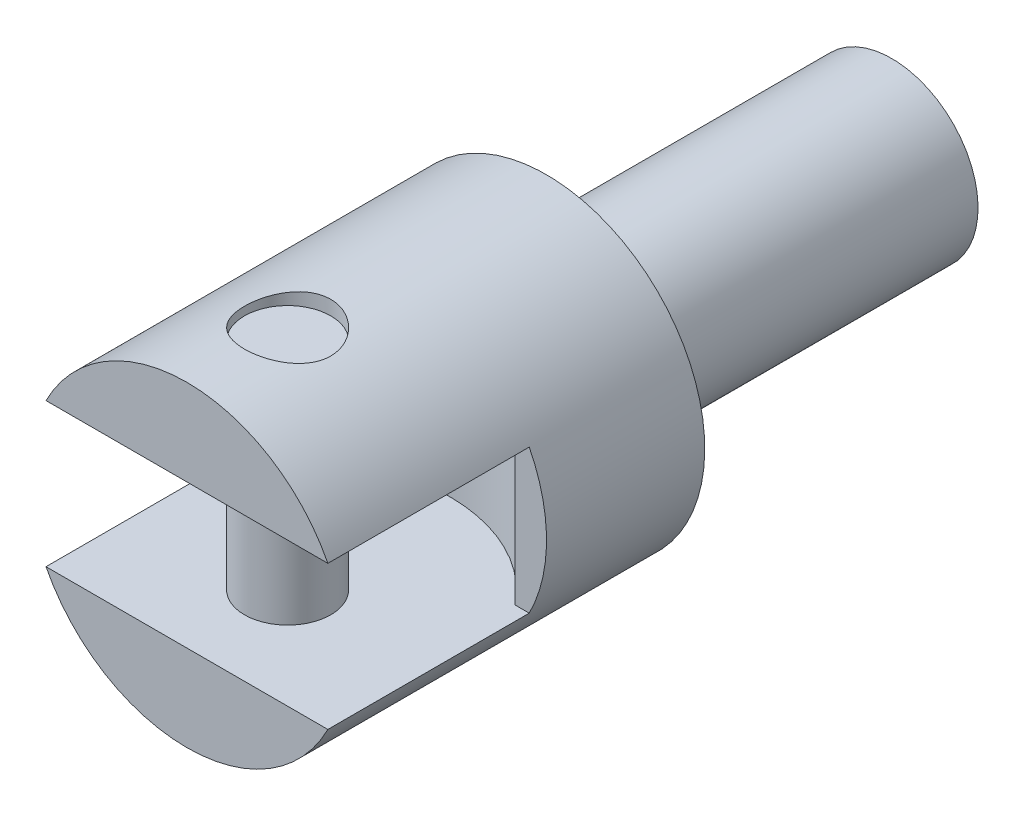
ISO-10303-21;
HEADER;
FILE_DESCRIPTION(('STEP AP214'),'2;1');
FILE_NAME('part.step','',(''),(''),'','','');
FILE_SCHEMA(('AUTOMOTIVE_DESIGN { 1 0 10303 214 1 1 1 1 }'));
ENDSEC;
DATA;
#1=APPLICATION_CONTEXT('core data for automotive mechanical design processes');
#2=APPLICATION_PROTOCOL_DEFINITION('international standard','automotive_design',2000,#1);
#3=PRODUCT_CONTEXT('',#1,'mechanical');
#4=PRODUCT('Part','Part','',(#3));
#5=PRODUCT_RELATED_PRODUCT_CATEGORY('part','',(#4));
#6=PRODUCT_DEFINITION_FORMATION('','',#4);
#7=PRODUCT_DEFINITION_CONTEXT('part definition',#1,'design');
#8=PRODUCT_DEFINITION('design','',#6,#7);
#9=PRODUCT_DEFINITION_SHAPE('','',#8);
#10=(LENGTH_UNIT() NAMED_UNIT(*) SI_UNIT(.MILLI.,.METRE.));
#11=(NAMED_UNIT(*) PLANE_ANGLE_UNIT() SI_UNIT($,.RADIAN.));
#12=(NAMED_UNIT(*) SI_UNIT($,.STERADIAN.) SOLID_ANGLE_UNIT());
#13=UNCERTAINTY_MEASURE_WITH_UNIT(LENGTH_MEASURE(1.E-05),#10,'distance_accuracy_value','');
#14=(GEOMETRIC_REPRESENTATION_CONTEXT(3) GLOBAL_UNCERTAINTY_ASSIGNED_CONTEXT((#13)) GLOBAL_UNIT_ASSIGNED_CONTEXT((#10,
#11,#12)) REPRESENTATION_CONTEXT('',''));
#15=CARTESIAN_POINT('',(0.,0.,0.));
#16=DIRECTION('',(0.,0.,1.));
#17=DIRECTION('',(1.,0.,0.));
#18=AXIS2_PLACEMENT_3D('',#15,#16,#17);
#19=CARTESIAN_POINT('',(0.,10.,18.));
#20=DIRECTION('',(0.,-1.,0.));
#21=DIRECTION('',(1.,0.,0.));
#22=AXIS2_PLACEMENT_3D('',#19,#20,#21);
#23=CYLINDRICAL_SURFACE('',#22,3.);
#24=CARTESIAN_POINT('',(0.,-5.,18.));
#25=DIRECTION('',(0.,1.,0.));
#26=DIRECTION('',(-1.,0.,0.));
#27=AXIS2_PLACEMENT_3D('',#24,#25,#26);
#28=CIRCLE('',#27,3.);
#29=CARTESIAN_POINT('',(-3.,-5.,18.));
#30=VERTEX_POINT('',#29);
#31=EDGE_CURVE('E92',#30,#30,#28,.T.);
#32=ORIENTED_EDGE('',*,*,#31,.T.);
#33=EDGE_LOOP('',(#32));
#34=FACE_BOUND('',#33,.T.);
#35=CARTESIAN_POINT('',(0.,5.,18.));
#36=DIRECTION('',(0.,1.,0.));
#37=DIRECTION('',(0.,0.,1.));
#38=AXIS2_PLACEMENT_3D('',#35,#36,#37);
#39=CIRCLE('',#38,3.);
#40=CARTESIAN_POINT('',(0.,5.,21.));
#41=VERTEX_POINT('',#40);
#42=EDGE_CURVE('E9',#41,#41,#39,.T.);
#43=ORIENTED_EDGE('',*,*,#42,.F.);
#44=EDGE_LOOP('',(#43));
#45=FACE_BOUND('',#44,.T.);
#46=ADVANCED_FACE('F14',(#34,#45),#23,.T.);
#47=CARTESIAN_POINT('',(0.,-14.,18.));
#48=DIRECTION('',(0.,1.,0.));
#49=DIRECTION('',(-1.,0.,0.));
#50=AXIS2_PLACEMENT_3D('',#47,#48,#49);
#51=CYLINDRICAL_SURFACE('',#50,3.);
#52=CARTESIAN_POINT('',(0.,-11.,21.));
#53=CARTESIAN_POINT('',(-0.165241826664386,-10.9999976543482,20.9999963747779));
#54=CARTESIAN_POINT('',(-0.330521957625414,-10.9962401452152,20.9863018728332));
#55=CARTESIAN_POINT('',(-0.656311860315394,-10.981615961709,20.9319883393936));
#56=CARTESIAN_POINT('',(-0.816819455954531,-10.97074609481,20.8913572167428));
#57=CARTESIAN_POINT('',(-1.12831525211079,-10.9430954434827,20.7845965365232));
#58=CARTESIAN_POINT('',(-1.27931573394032,-10.9263224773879,20.7185006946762));
#59=CARTESIAN_POINT('',(-1.56808899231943,-10.888633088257,20.5628141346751));
#60=CARTESIAN_POINT('',(-1.70586072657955,-10.8677163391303,20.4732215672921));
#61=CARTESIAN_POINT('',(-1.96759389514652,-10.8234279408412,20.2708003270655));
#62=CARTESIAN_POINT('',(-2.09119025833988,-10.8000128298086,20.1575091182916));
#63=CARTESIAN_POINT('',(-2.31788587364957,-10.7536422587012,19.9118947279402));
#64=CARTESIAN_POINT('',(-2.42098235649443,-10.7306868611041,19.7795689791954));
#65=CARTESIAN_POINT('',(-2.60555589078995,-10.6873876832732,19.496697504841));
#66=CARTESIAN_POINT('',(-2.68660853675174,-10.6670986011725,19.3458657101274));
#67=CARTESIAN_POINT('',(-2.82205832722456,-10.6320701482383,19.0320723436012));
#68=CARTESIAN_POINT('',(-2.87646063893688,-10.6173297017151,18.869113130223));
#69=CARTESIAN_POINT('',(-2.95578912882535,-10.5955169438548,18.539744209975));
#70=CARTESIAN_POINT('',(-2.98137921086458,-10.5882722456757,18.3735061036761));
#71=CARTESIAN_POINT('',(-3.00442728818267,-10.5817565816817,18.0389506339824));
#72=CARTESIAN_POINT('',(-3.00189080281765,-10.5824840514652,17.8706336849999));
#73=CARTESIAN_POINT('',(-2.96928383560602,-10.5916764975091,17.5419168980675));
#74=CARTESIAN_POINT('',(-2.94002147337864,-10.5999143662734,17.3814295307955));
#75=CARTESIAN_POINT('',(-2.85608967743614,-10.6228351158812,17.0677334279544));
#76=CARTESIAN_POINT('',(-2.80141813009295,-10.6375185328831,16.9145252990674));
#77=CARTESIAN_POINT('',(-2.6675725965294,-10.6718723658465,16.6176529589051));
#78=CARTESIAN_POINT('',(-2.58811903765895,-10.6915991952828,16.4741215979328));
#79=CARTESIAN_POINT('',(-2.40715976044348,-10.7337873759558,16.2021471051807));
#80=CARTESIAN_POINT('',(-2.30564952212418,-10.756249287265,16.0737070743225));
#81=CARTESIAN_POINT('',(-2.07934693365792,-10.8023178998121,15.8309496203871));
#82=CARTESIAN_POINT('',(-1.9538772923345,-10.8259374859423,15.7172651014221));
#83=CARTESIAN_POINT('',(-1.68536402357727,-10.8709729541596,15.5124180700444));
#84=CARTESIAN_POINT('',(-1.54231963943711,-10.8923887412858,15.4212565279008));
#85=CARTESIAN_POINT('',(-1.24170790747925,-10.9307455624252,15.2637466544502));
#86=CARTESIAN_POINT('',(-1.08407527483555,-10.9476650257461,15.1975173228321));
#87=CARTESIAN_POINT('',(-0.759345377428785,-10.9749671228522,15.0926840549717));
#88=CARTESIAN_POINT('',(-0.592250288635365,-10.9853512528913,15.0540737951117));
#89=CARTESIAN_POINT('',(-0.2587363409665,-10.9981845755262,15.0065787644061));
#90=CARTESIAN_POINT('',(-0.0924485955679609,-11.0008632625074,14.9968340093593));
#91=CARTESIAN_POINT('',(0.239386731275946,-10.9986460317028,15.0049654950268));
#92=CARTESIAN_POINT('',(0.40493439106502,-10.9937509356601,15.022838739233));
#93=CARTESIAN_POINT('',(0.727490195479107,-10.977084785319,15.0849950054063));
#94=CARTESIAN_POINT('',(0.884598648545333,-10.965439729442,15.128794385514));
#95=CARTESIAN_POINT('',(1.18921973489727,-10.9365984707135,15.240994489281));
#96=CARTESIAN_POINT('',(1.33673130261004,-10.9194016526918,15.3093979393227));
#97=CARTESIAN_POINT('',(1.62128232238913,-10.8808314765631,15.4704328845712));
#98=CARTESIAN_POINT('',(1.75804920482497,-10.8593805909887,15.5635269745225));
#99=CARTESIAN_POINT('',(2.01432044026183,-10.8147797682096,15.770722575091));
#100=CARTESIAN_POINT('',(2.133821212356,-10.7916294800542,15.8848284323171));
#101=CARTESIAN_POINT('',(2.35582120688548,-10.7453880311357,16.1348280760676));
#102=CARTESIAN_POINT('',(2.45771255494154,-10.7223188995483,16.2712667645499));
#103=CARTESIAN_POINT('',(2.63717164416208,-10.6796005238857,16.5597972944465));
#104=CARTESIAN_POINT('',(2.71474035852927,-10.6599511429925,16.7118885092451));
#105=CARTESIAN_POINT('',(2.84277116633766,-10.6265249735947,17.0266812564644));
#106=CARTESIAN_POINT('',(2.8933870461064,-10.6127149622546,17.1893165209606));
#107=CARTESIAN_POINT('',(2.9664183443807,-10.5925362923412,17.5212336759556));
#108=CARTESIAN_POINT('',(2.98884137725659,-10.586165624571,17.6905137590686));
#109=CARTESIAN_POINT('',(3.00439791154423,-10.5817601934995,18.0246768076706));
#110=CARTESIAN_POINT('',(2.99851066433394,-10.5834467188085,18.1895111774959));
#111=CARTESIAN_POINT('',(2.95989675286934,-10.5943100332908,18.5157412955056));
#112=CARTESIAN_POINT('',(2.92717084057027,-10.6034866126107,18.6771371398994));
#113=CARTESIAN_POINT('',(2.83638816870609,-10.6281263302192,18.9906126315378));
#114=CARTESIAN_POINT('',(2.77854790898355,-10.6435356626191,19.1427595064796));
#115=CARTESIAN_POINT('',(2.63934609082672,-10.6789037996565,19.4353065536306));
#116=CARTESIAN_POINT('',(2.55798069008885,-10.6988633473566,19.5757048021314));
#117=CARTESIAN_POINT('',(2.37110861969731,-10.7418475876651,19.8454211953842));
#118=CARTESIAN_POINT('',(2.26493803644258,-10.7649475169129,19.9742674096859));
#119=CARTESIAN_POINT('',(2.0327202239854,-10.8111998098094,20.2126328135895));
#120=CARTESIAN_POINT('',(1.90666811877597,-10.834352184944,20.3221472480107));
#121=CARTESIAN_POINT('',(1.63481545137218,-10.8787291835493,20.5211892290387));
#122=CARTESIAN_POINT('',(1.48863173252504,-10.8998981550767,20.6102069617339));
#123=CARTESIAN_POINT('',(1.18279979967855,-10.9373052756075,20.762264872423));
#124=CARTESIAN_POINT('',(1.02315990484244,-10.9535464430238,20.8253209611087));
#125=CARTESIAN_POINT('',(0.720200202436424,-10.9772838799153,20.915879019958));
#126=CARTESIAN_POINT('',(0.578129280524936,-10.9857389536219,20.9473491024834));
#127=CARTESIAN_POINT('',(0.290715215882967,-10.997097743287,20.9894100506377));
#128=CARTESIAN_POINT('',(0.145372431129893,-11.0000020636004,21.0000031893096));
#129=CARTESIAN_POINT('',(0.,-11.,21.));
#130=B_SPLINE_CURVE_WITH_KNOTS('',3,(#52,#53,#54,#55,#56,#57,#58,#59,#60,#61,#62,#63,#64,#65,
#66,#67,#68,#69,#70,#71,#72,#73,#74,#75,#76,#77,#78,#79,#80,#81,#82,#83,#84,#85,#86,#87,#88,#89,
#90,#91,#92,#93,#94,#95,#96,#97,#98,#99,#100,#101,#102,#103,#104,#105,#106,#107,#108,#109,#110,
#111,#112,#113,#114,#115,#116,#117,#118,#119,#120,#121,#122,#123,#124,#125,#126,#127,#128,#129),
.UNSPECIFIED.,.T.,.F.,(4,2,2,2,2,2,2,2,2,2,2,2,2,2,2,2,2,2,2,2,2,2,2,2,2,2,2,2,2,2,2,2,2,2,2,2,
2,2,4),(0.,0.495192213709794,0.990606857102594,1.48536780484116,1.98016770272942,
2.48571756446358,2.99133567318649,3.50609187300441,4.02074822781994,4.52328609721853,
5.02572535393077,5.51345773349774,6.00123069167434,6.49471853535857,6.98830760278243,
7.4987705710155,8.00925552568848,8.52214699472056,9.03492099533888,9.53225622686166,
10.029537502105,10.5178222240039,11.0061610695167,11.5043893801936,12.0027208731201,
12.5158014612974,13.0288615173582,13.5389619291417,14.0489245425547,14.5413770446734,
15.0338157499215,15.5220911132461,16.0104462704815,16.5137802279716,17.0172378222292,
17.532117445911,18.0466810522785,18.4823766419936,18.9180247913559),.UNSPECIFIED.);
#131=CARTESIAN_POINT('',(0.,-11.,21.));
#132=VERTEX_POINT('',#131);
#133=EDGE_CURVE('E107',#132,#132,#130,.T.);
#134=ORIENTED_EDGE('',*,*,#133,.T.);
#135=EDGE_LOOP('',(#134));
#136=FACE_BOUND('',#135,.T.);
#137=CARTESIAN_POINT('',(0.,-10.,18.));
#138=DIRECTION('',(0.,1.,0.));
#139=DIRECTION('',(-1.,0.,0.));
#140=AXIS2_PLACEMENT_3D('',#137,#138,#139);
#141=CIRCLE('',#140,3.);
#142=CARTESIAN_POINT('',(-3.,-10.,18.));
#143=VERTEX_POINT('',#142);
#144=EDGE_CURVE('E21',#143,#143,#141,.T.);
#145=ORIENTED_EDGE('',*,*,#144,.T.);
#146=EDGE_LOOP('',(#145));
#147=FACE_BOUND('',#146,.T.);
#148=ADVANCED_FACE('F115',(#136,#147),#51,.F.);
#149=CARTESIAN_POINT('',(-4.7,0.,0.));
#150=DIRECTION('',(0.,0.,-1.));
#151=DIRECTION('',(0.,-1.,0.));
#152=AXIS2_PLACEMENT_3D('',#149,#150,#151);
#153=PLANE('',#152);
#154=CARTESIAN_POINT('',(0.,0.,0.));
#155=DIRECTION('',(0.,0.,-1.));
#156=DIRECTION('',(0.,-1.,0.));
#157=AXIS2_PLACEMENT_3D('',#154,#155,#156);
#158=CIRCLE('',#157,4.7);
#159=CARTESIAN_POINT('',(0.,-4.7,0.));
#160=VERTEX_POINT('',#159);
#161=EDGE_CURVE('E303',#160,#160,#158,.T.);
#162=ORIENTED_EDGE('',*,*,#161,.F.);
#163=EDGE_LOOP('',(#162));
#164=FACE_BOUND('',#163,.T.);
#165=CARTESIAN_POINT('',(0.,0.,0.));
#166=DIRECTION('',(0.,0.,-1.));
#167=DIRECTION('',(0.,-1.,0.));
#168=AXIS2_PLACEMENT_3D('',#165,#166,#167);
#169=CIRCLE('',#168,11.);
#170=CARTESIAN_POINT('',(0.,-11.,0.));
#171=VERTEX_POINT('',#170);
#172=EDGE_CURVE('E89',#171,#171,#169,.T.);
#173=ORIENTED_EDGE('',*,*,#172,.T.);
#174=EDGE_LOOP('',(#173));
#175=FACE_BOUND('',#174,.T.);
#176=ADVANCED_FACE('F119',(#164,#175),#153,.T.);
#177=CARTESIAN_POINT('',(0.,0.,0.));
#178=DIRECTION('',(0.,0.,-1.));
#179=DIRECTION('',(0.,-1.,0.));
#180=AXIS2_PLACEMENT_3D('',#177,#178,#179);
#181=CYLINDRICAL_SURFACE('',#180,4.7);
#182=ORIENTED_EDGE('',*,*,#161,.T.);
#183=EDGE_LOOP('',(#182));
#184=FACE_BOUND('',#183,.T.);
#185=CARTESIAN_POINT('',(0.,0.,-3.));
#186=DIRECTION('',(0.,0.,-1.));
#187=DIRECTION('',(0.,-1.,0.));
#188=AXIS2_PLACEMENT_3D('',#185,#186,#187);
#189=CIRCLE('',#188,4.7);
#190=CARTESIAN_POINT('',(0.,-4.7,-3.));
#191=VERTEX_POINT('',#190);
#192=EDGE_CURVE('E306',#191,#191,#189,.T.);
#193=ORIENTED_EDGE('',*,*,#192,.F.);
#194=EDGE_LOOP('',(#193));
#195=FACE_BOUND('',#194,.T.);
#196=ADVANCED_FACE('F154',(#184,#195),#181,.T.);
#197=CARTESIAN_POINT('',(-6.,0.,-3.));
#198=DIRECTION('',(0.,0.,1.));
#199=DIRECTION('',(0.,1.,0.));
#200=AXIS2_PLACEMENT_3D('',#197,#198,#199);
#201=PLANE('',#200);
#202=ORIENTED_EDGE('',*,*,#192,.T.);
#203=EDGE_LOOP('',(#202));
#204=FACE_BOUND('',#203,.T.);
#205=CARTESIAN_POINT('',(0.,0.,-3.));
#206=DIRECTION('',(0.,0.,-1.));
#207=DIRECTION('',(0.,-1.,0.));
#208=AXIS2_PLACEMENT_3D('',#205,#206,#207);
#209=CIRCLE('',#208,6.);
#210=CARTESIAN_POINT('',(0.,-6.,-3.));
#211=VERTEX_POINT('',#210);
#212=EDGE_CURVE('E309',#211,#211,#209,.T.);
#213=ORIENTED_EDGE('',*,*,#212,.F.);
#214=EDGE_LOOP('',(#213));
#215=FACE_BOUND('',#214,.T.);
#216=ADVANCED_FACE('F150',(#204,#215),#201,.T.);
#217=CARTESIAN_POINT('',(0.,0.,0.));
#218=DIRECTION('',(0.,0.,-1.));
#219=DIRECTION('',(0.,-1.,0.));
#220=AXIS2_PLACEMENT_3D('',#217,#218,#219);
#221=CYLINDRICAL_SURFACE('',#220,6.);
#222=ORIENTED_EDGE('',*,*,#212,.T.);
#223=EDGE_LOOP('',(#222));
#224=FACE_BOUND('',#223,.T.);
#225=CARTESIAN_POINT('',(0.,0.,-24.));
#226=DIRECTION('',(0.,0.,-1.));
#227=DIRECTION('',(0.,-1.,0.));
#228=AXIS2_PLACEMENT_3D('',#225,#226,#227);
#229=CIRCLE('',#228,6.);
#230=CARTESIAN_POINT('',(0.,-6.,-24.));
#231=VERTEX_POINT('',#230);
#232=EDGE_CURVE('E312',#231,#231,#229,.T.);
#233=ORIENTED_EDGE('',*,*,#232,.F.);
#234=EDGE_LOOP('',(#233));
#235=FACE_BOUND('',#234,.T.);
#236=ADVANCED_FACE('F146',(#224,#235),#221,.T.);
#237=CARTESIAN_POINT('',(0.,0.,-24.));
#238=DIRECTION('',(0.,0.,-1.));
#239=DIRECTION('',(0.,-1.,0.));
#240=AXIS2_PLACEMENT_3D('',#237,#238,#239);
#241=PLANE('',#240);
#242=ORIENTED_EDGE('',*,*,#232,.T.);
#243=EDGE_LOOP('',(#242));
#244=FACE_BOUND('',#243,.T.);
#245=ADVANCED_FACE('F140',(#244),#241,.T.);
#246=CARTESIAN_POINT('',(0.,-5.,18.));
#247=DIRECTION('',(0.,1.,0.));
#248=DIRECTION('',(-1.,0.,0.));
#249=AXIS2_PLACEMENT_3D('',#246,#247,#248);
#250=CYLINDRICAL_SURFACE('',#249,11.25);
#251=CARTESIAN_POINT('',(0.,5.,18.));
#252=DIRECTION('',(0.,1.,0.));
#253=DIRECTION('',(-1.,0.,0.));
#254=AXIS2_PLACEMENT_3D('',#251,#252,#253);
#255=CIRCLE('',#254,11.25);
#256=CARTESIAN_POINT('',(8.80695747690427,5.,11.));
#257=VERTEX_POINT('',#256);
#258=CARTESIAN_POINT('',(-9.18218383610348,5.,11.5));
#259=VERTEX_POINT('',#258);
#260=EDGE_CURVE('E328',#257,#259,#255,.T.);
#261=ORIENTED_EDGE('',*,*,#260,.T.);
#262=DIRECTION('',(0.,1.,0.));
#263=VECTOR('',#262,1.);
#264=CARTESIAN_POINT('',(-9.18218383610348,-5.,11.5));
#265=LINE('',#264,#263);
#266=CARTESIAN_POINT('',(-9.18218383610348,-5.,11.5));
#267=VERTEX_POINT('',#266);
#268=EDGE_CURVE('E320',#267,#259,#265,.T.);
#269=ORIENTED_EDGE('',*,*,#268,.F.);
#270=CARTESIAN_POINT('',(0.,-5.,18.));
#271=DIRECTION('',(0.,1.,0.));
#272=DIRECTION('',(-1.,0.,0.));
#273=AXIS2_PLACEMENT_3D('',#270,#271,#272);
#274=CIRCLE('',#273,11.25);
#275=CARTESIAN_POINT('',(8.80695747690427,-5.,11.));
#276=VERTEX_POINT('',#275);
#277=EDGE_CURVE('E325',#276,#267,#274,.T.);
#278=ORIENTED_EDGE('',*,*,#277,.F.);
#279=DIRECTION('',(0.,1.,0.));
#280=VECTOR('',#279,1.);
#281=CARTESIAN_POINT('',(8.80695747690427,-5.,11.));
#282=LINE('',#281,#280);
#283=EDGE_CURVE('E76',#276,#257,#282,.T.);
#284=ORIENTED_EDGE('',*,*,#283,.T.);
#285=EDGE_LOOP('',(#261,#269,#278,#284));
#286=FACE_BOUND('',#285,.T.);
#287=ADVANCED_FACE('F137',(#286),#250,.F.);
#288=CARTESIAN_POINT('',(0.,0.,25.));
#289=DIRECTION('',(0.,0.,1.));
#290=DIRECTION('',(0.,1.,0.));
#291=AXIS2_PLACEMENT_3D('',#288,#289,#290);
#292=PLANE('',#291);
#293=DIRECTION('',(1.,0.,0.));
#294=VECTOR('',#293,1.);
#295=CARTESIAN_POINT('',(-11.,-5.,25.));
#296=LINE('',#295,#294);
#297=CARTESIAN_POINT('',(-9.79795897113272,-5.,25.));
#298=VERTEX_POINT('',#297);
#299=CARTESIAN_POINT('',(9.79795897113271,-5.,25.));
#300=VERTEX_POINT('',#299);
#301=EDGE_CURVE('E332',#298,#300,#296,.T.);
#302=ORIENTED_EDGE('',*,*,#301,.F.);
#303=CARTESIAN_POINT('',(0.,0.,25.));
#304=DIRECTION('',(0.,0.,1.));
#305=DIRECTION('',(0.,1.,0.));
#306=AXIS2_PLACEMENT_3D('',#303,#304,#305);
#307=CIRCLE('',#306,11.);
#308=EDGE_CURVE('E88',#298,#300,#307,.T.);
#309=ORIENTED_EDGE('',*,*,#308,.T.);
#310=EDGE_LOOP('',(#302,#309));
#311=FACE_BOUND('',#310,.T.);
#312=ADVANCED_FACE('F133',(#311),#292,.T.);
#313=CARTESIAN_POINT('',(8.80695747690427,-5.,11.));
#314=DIRECTION('',(0.,0.,-1.));
#315=DIRECTION('',(0.,-1.,0.));
#316=AXIS2_PLACEMENT_3D('',#313,#314,#315);
#317=PLANE('',#316);
#318=DIRECTION('',(-1.,0.,0.));
#319=VECTOR('',#318,1.);
#320=CARTESIAN_POINT('',(8.80695747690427,-5.,11.));
#321=LINE('',#320,#319);
#322=CARTESIAN_POINT('',(9.79795897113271,-5.,11.));
#323=VERTEX_POINT('',#322);
#324=EDGE_CURVE('E322',#323,#276,#321,.T.);
#325=ORIENTED_EDGE('',*,*,#324,.F.);
#326=CARTESIAN_POINT('',(0.,0.,11.));
#327=DIRECTION('',(0.,0.,-1.));
#328=DIRECTION('',(0.,-1.,0.));
#329=AXIS2_PLACEMENT_3D('',#326,#327,#328);
#330=CIRCLE('',#329,11.);
#331=CARTESIAN_POINT('',(9.79795897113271,5.,11.));
#332=VERTEX_POINT('',#331);
#333=EDGE_CURVE('E36',#323,#332,#330,.F.);
#334=ORIENTED_EDGE('',*,*,#333,.T.);
#335=DIRECTION('',(-1.,0.,0.));
#336=VECTOR('',#335,1.);
#337=CARTESIAN_POINT('',(8.80695747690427,5.,11.));
#338=LINE('',#337,#336);
#339=EDGE_CURVE('E84',#332,#257,#338,.T.);
#340=ORIENTED_EDGE('',*,*,#339,.T.);
#341=ORIENTED_EDGE('',*,*,#283,.F.);
#342=EDGE_LOOP('',(#325,#334,#340,#341));
#343=FACE_BOUND('',#342,.T.);
#344=ADVANCED_FACE('F130',(#343),#317,.F.);
#345=DIRECTION('',(1.,0.,0.));
#346=VECTOR('',#345,1.);
#347=CARTESIAN_POINT('',(-11.,5.,25.));
#348=LINE('',#347,#346);
#349=CARTESIAN_POINT('',(-9.79795897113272,5.,25.));
#350=VERTEX_POINT('',#349);
#351=CARTESIAN_POINT('',(9.79795897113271,5.,25.));
#352=VERTEX_POINT('',#351);
#353=EDGE_CURVE('E79',#350,#352,#348,.T.);
#354=ORIENTED_EDGE('',*,*,#353,.T.);
#355=CARTESIAN_POINT('',(0.,0.,25.));
#356=DIRECTION('',(0.,0.,1.));
#357=DIRECTION('',(0.,1.,0.));
#358=AXIS2_PLACEMENT_3D('',#355,#356,#357);
#359=CIRCLE('',#358,11.);
#360=EDGE_CURVE('E72',#352,#350,#359,.T.);
#361=ORIENTED_EDGE('',*,*,#360,.T.);
#362=EDGE_LOOP('',(#354,#361));
#363=FACE_BOUND('',#362,.T.);
#364=ADVANCED_FACE('F87',(#363),#292,.T.);
#365=CARTESIAN_POINT('',(0.,5.,18.));
#366=DIRECTION('',(0.,1.,0.));
#367=DIRECTION('',(-1.,0.,0.));
#368=AXIS2_PLACEMENT_3D('',#365,#366,#367);
#369=PLANE('',#368);
#370=ORIENTED_EDGE('',*,*,#353,.F.);
#371=DIRECTION('',(0.,0.,-1.));
#372=VECTOR('',#371,1.);
#373=CARTESIAN_POINT('',(-9.79795897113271,5.,0.));
#374=LINE('',#373,#372);
#375=CARTESIAN_POINT('',(-9.79795897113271,5.,11.5));
#376=VERTEX_POINT('',#375);
#377=EDGE_CURVE('E66',#350,#376,#374,.T.);
#378=ORIENTED_EDGE('',*,*,#377,.T.);
#379=DIRECTION('',(-1.,0.,0.));
#380=VECTOR('',#379,1.);
#381=CARTESIAN_POINT('',(-9.18218383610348,5.,11.5));
#382=LINE('',#381,#380);
#383=EDGE_CURVE('E85',#259,#376,#382,.T.);
#384=ORIENTED_EDGE('',*,*,#383,.F.);
#385=ORIENTED_EDGE('',*,*,#260,.F.);
#386=ORIENTED_EDGE('',*,*,#339,.F.);
#387=DIRECTION('',(0.,0.,-1.));
#388=VECTOR('',#387,1.);
#389=CARTESIAN_POINT('',(9.79795897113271,5.,0.));
#390=LINE('',#389,#388);
#391=EDGE_CURVE('E75',#332,#352,#390,.F.);
#392=ORIENTED_EDGE('',*,*,#391,.T.);
#393=EDGE_LOOP('',(#370,#378,#384,#385,#386,#392));
#394=FACE_BOUND('',#393,.T.);
#395=ORIENTED_EDGE('',*,*,#42,.T.);
#396=EDGE_LOOP('',(#395));
#397=FACE_BOUND('',#396,.T.);
#398=ADVANCED_FACE('F80',(#394,#397),#369,.F.);
#399=CARTESIAN_POINT('',(-9.18218383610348,-5.,11.5));
#400=DIRECTION('',(0.,0.,-1.));
#401=DIRECTION('',(0.,-1.,0.));
#402=AXIS2_PLACEMENT_3D('',#399,#400,#401);
#403=PLANE('',#402);
#404=CARTESIAN_POINT('',(0.,0.,11.5));
#405=DIRECTION('',(0.,0.,-1.));
#406=DIRECTION('',(0.,-1.,0.));
#407=AXIS2_PLACEMENT_3D('',#404,#405,#406);
#408=CIRCLE('',#407,11.);
#409=CARTESIAN_POINT('',(-9.79795897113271,-5.,11.5));
#410=VERTEX_POINT('',#409);
#411=EDGE_CURVE('E28',#376,#410,#408,.F.);
#412=ORIENTED_EDGE('',*,*,#411,.T.);
#413=DIRECTION('',(-1.,0.,0.));
#414=VECTOR('',#413,1.);
#415=CARTESIAN_POINT('',(-9.18218383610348,-5.,11.5));
#416=LINE('',#415,#414);
#417=EDGE_CURVE('E335',#267,#410,#416,.T.);
#418=ORIENTED_EDGE('',*,*,#417,.F.);
#419=ORIENTED_EDGE('',*,*,#268,.T.);
#420=ORIENTED_EDGE('',*,*,#383,.T.);
#421=EDGE_LOOP('',(#412,#418,#419,#420));
#422=FACE_BOUND('',#421,.T.);
#423=ADVANCED_FACE('F126',(#422),#403,.F.);
#424=CARTESIAN_POINT('',(0.,-5.,18.));
#425=DIRECTION('',(0.,1.,0.));
#426=DIRECTION('',(-1.,0.,0.));
#427=AXIS2_PLACEMENT_3D('',#424,#425,#426);
#428=PLANE('',#427);
#429=ORIENTED_EDGE('',*,*,#301,.T.);
#430=DIRECTION('',(0.,0.,-1.));
#431=VECTOR('',#430,1.);
#432=CARTESIAN_POINT('',(9.79795897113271,-5.,0.));
#433=LINE('',#432,#431);
#434=EDGE_CURVE('E315',#323,#300,#433,.F.);
#435=ORIENTED_EDGE('',*,*,#434,.F.);
#436=ORIENTED_EDGE('',*,*,#324,.T.);
#437=ORIENTED_EDGE('',*,*,#277,.T.);
#438=ORIENTED_EDGE('',*,*,#417,.T.);
#439=DIRECTION('',(0.,0.,-1.));
#440=VECTOR('',#439,1.);
#441=CARTESIAN_POINT('',(-9.79795897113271,-5.,0.));
#442=LINE('',#441,#440);
#443=EDGE_CURVE('E317',#298,#410,#442,.T.);
#444=ORIENTED_EDGE('',*,*,#443,.F.);
#445=EDGE_LOOP('',(#429,#435,#436,#437,#438,#444));
#446=FACE_BOUND('',#445,.T.);
#447=ORIENTED_EDGE('',*,*,#31,.F.);
#448=EDGE_LOOP('',(#447));
#449=FACE_BOUND('',#448,.T.);
#450=ADVANCED_FACE('F122',(#446,#449),#428,.T.);
#451=CARTESIAN_POINT('',(0.,10.,18.));
#452=DIRECTION('',(0.,1.,0.));
#453=DIRECTION('',(0.,0.,1.));
#454=AXIS2_PLACEMENT_3D('',#451,#452,#453);
#455=CIRCLE('',#454,3.);
#456=CARTESIAN_POINT('',(0.,10.,21.));
#457=VERTEX_POINT('',#456);
#458=EDGE_CURVE('E297',#457,#457,#455,.T.);
#459=ORIENTED_EDGE('',*,*,#458,.F.);
#460=EDGE_LOOP('',(#459));
#461=FACE_BOUND('',#460,.T.);
#462=CARTESIAN_POINT('',(-3.,10.5830052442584,18.));
#463=CARTESIAN_POINT('',(-2.99999631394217,10.583007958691,18.1651129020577));
#464=CARTESIAN_POINT('',(-2.9863224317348,10.5869115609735,18.3302642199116));
#465=CARTESIAN_POINT('',(-2.93209821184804,10.6020548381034,18.6557870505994));
#466=CARTESIAN_POINT('',(-2.8915351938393,10.6132979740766,18.8161562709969));
#467=CARTESIAN_POINT('',(-2.78497349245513,10.6417543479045,19.1273583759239));
#468=CARTESIAN_POINT('',(-2.71901169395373,10.6589589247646,19.2782047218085));
#469=CARTESIAN_POINT('',(-2.56364148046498,10.697388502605,19.5667162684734));
#470=CARTESIAN_POINT('',(-2.47423093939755,10.7186138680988,19.7043802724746));
#471=CARTESIAN_POINT('',(-2.27199971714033,10.7633157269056,19.9662204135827));
#472=CARTESIAN_POINT('',(-2.15867548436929,10.786833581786,20.0900006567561));
#473=CARTESIAN_POINT('',(-1.9129160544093,10.8331142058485,20.317055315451));
#474=CARTESIAN_POINT('',(-1.78047880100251,10.8558768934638,20.420327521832));
#475=CARTESIAN_POINT('',(-1.49749518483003,10.8985454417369,20.605097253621));
#476=CARTESIAN_POINT('',(-1.3466817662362,10.9183968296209,20.6861994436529));
#477=CARTESIAN_POINT('',(-1.03292742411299,10.9525304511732,20.8217457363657));
#478=CARTESIAN_POINT('',(-0.869988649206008,10.9668136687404,20.8761945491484));
#479=CARTESIAN_POINT('',(-0.540742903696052,10.9879091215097,20.9556021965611));
#480=CARTESIAN_POINT('',(-0.37460956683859,10.994891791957,20.9812348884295));
#481=CARTESIAN_POINT('',(-0.0402637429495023,11.0011960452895,21.0044046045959));
#482=CARTESIAN_POINT('',(0.127948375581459,11.0005189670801,21.0019465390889));
#483=CARTESIAN_POINT('',(0.456980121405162,10.9917041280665,20.9694752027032));
#484=CARTESIAN_POINT('',(0.61787771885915,10.9837635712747,20.9401902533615));
#485=CARTESIAN_POINT('',(0.932382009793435,10.9615478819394,20.8560753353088));
#486=CARTESIAN_POINT('',(1.08598827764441,10.9472723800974,20.8012438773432));
#487=CARTESIAN_POINT('',(1.38338647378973,10.9137017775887,20.6670457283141));
#488=CARTESIAN_POINT('',(1.52706155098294,10.8943566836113,20.5874331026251));
#489=CARTESIAN_POINT('',(1.79925853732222,10.852725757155,20.4061222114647));
#490=CARTESIAN_POINT('',(1.9277773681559,10.8304393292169,20.3044194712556));
#491=CARTESIAN_POINT('',(2.17036149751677,10.784492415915,20.07796400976));
#492=CARTESIAN_POINT('',(2.28383106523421,10.7608107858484,19.9525766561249));
#493=CARTESIAN_POINT('',(2.48828152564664,10.715383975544,19.6843095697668));
#494=CARTESIAN_POINT('',(2.57926091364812,10.6936389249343,19.541428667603));
#495=CARTESIAN_POINT('',(2.73663009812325,10.6544594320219,19.2408912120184));
#496=CARTESIAN_POINT('',(2.80285088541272,10.6370548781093,19.0831419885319));
#497=CARTESIAN_POINT('',(2.90763299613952,10.6088947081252,18.7581547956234));
#498=CARTESIAN_POINT('',(2.94620154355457,10.5981373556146,18.5909193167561));
#499=CARTESIAN_POINT('',(2.99354252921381,10.5848615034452,18.2572956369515));
#500=CARTESIAN_POINT('',(3.00320658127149,10.5820965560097,18.0910436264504));
#501=CARTESIAN_POINT('',(2.99492665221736,10.5844430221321,17.7592977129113));
#502=CARTESIAN_POINT('',(2.97698576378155,10.5895535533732,17.5938037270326));
#503=CARTESIAN_POINT('',(2.91479275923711,10.6068364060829,17.2717551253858));
#504=CARTESIAN_POINT('',(2.87108313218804,10.6188630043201,17.1150871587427));
#505=CARTESIAN_POINT('',(2.75920663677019,10.6484790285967,16.8113079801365));
#506=CARTESIAN_POINT('',(2.69103646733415,10.6660692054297,16.664198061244));
#507=CARTESIAN_POINT('',(2.5303848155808,10.7053313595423,16.3799985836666));
#508=CARTESIAN_POINT('',(2.43738334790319,10.7270874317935,16.2432148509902));
#509=CARTESIAN_POINT('',(2.23034883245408,10.7720352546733,15.9868678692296));
#510=CARTESIAN_POINT('',(2.11631164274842,10.795227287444,15.8673080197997));
#511=CARTESIAN_POINT('',(1.86630672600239,10.8412873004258,15.6450672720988));
#512=CARTESIAN_POINT('',(1.72977769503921,10.8641239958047,15.5430099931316));
#513=CARTESIAN_POINT('',(1.44101111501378,10.9061791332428,15.363258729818));
#514=CARTESIAN_POINT('',(1.28877440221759,10.9253977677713,15.2855634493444));
#515=CARTESIAN_POINT('',(0.97398467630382,10.9579274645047,15.1574658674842));
#516=CARTESIAN_POINT('',(0.811520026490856,10.9712828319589,15.106858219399));
#517=CARTESIAN_POINT('',(0.479971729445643,10.9907764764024,15.0337860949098));
#518=CARTESIAN_POINT('',(0.31088963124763,10.9969164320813,15.0113150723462));
#519=CARTESIAN_POINT('',(-0.023279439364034,11.0012041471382,14.9955797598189));
#520=CARTESIAN_POINT('',(-0.188320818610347,10.9996016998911,15.0014026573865));
#521=CARTESIAN_POINT('',(-0.514982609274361,10.9891537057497,15.03995955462));
#522=CARTESIAN_POINT('',(-0.676603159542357,10.980308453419,15.0726924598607));
#523=CARTESIAN_POINT('',(-0.990684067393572,10.9564222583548,15.1636147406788));
#524=CARTESIAN_POINT('',(-1.14320402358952,10.9414282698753,15.2216113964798));
#525=CARTESIAN_POINT('',(-1.43643473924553,10.9068088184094,15.3612432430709));
#526=CARTESIAN_POINT('',(-1.57714378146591,10.8871826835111,15.4428818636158));
#527=CARTESIAN_POINT('',(-1.84697735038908,10.8447157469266,15.6301094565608));
#528=CARTESIAN_POINT('',(-1.97567408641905,10.821801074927,15.7362981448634));
#529=CARTESIAN_POINT('',(-2.2137299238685,10.77562687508,15.9684842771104));
#530=CARTESIAN_POINT('',(-2.32308384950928,10.7523672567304,16.0944870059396));
#531=CARTESIAN_POINT('',(-2.52187932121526,10.7075101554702,16.3662550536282));
#532=CARTESIAN_POINT('',(-2.61079759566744,10.685964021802,16.5124124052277));
#533=CARTESIAN_POINT('',(-2.7626761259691,10.6477131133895,16.8181718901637));
#534=CARTESIAN_POINT('',(-2.82565261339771,10.6310053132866,16.9777655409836));
#535=CARTESIAN_POINT('',(-2.91605222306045,10.6065296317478,17.2805360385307));
#536=CARTESIAN_POINT('',(-2.94745662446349,10.5977813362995,17.4224569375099));
#537=CARTESIAN_POINT('',(-2.98943081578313,10.5860183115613,17.7095755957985));
#538=CARTESIAN_POINT('',(-3.00000324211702,10.5830028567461,17.8547729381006));
#539=CARTESIAN_POINT('',(-3.,10.5830052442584,18.));
#540=B_SPLINE_CURVE_WITH_KNOTS('',3,(#462,#463,#464,#465,#466,#467,#468,#469,#470,#471,#472,
#473,#474,#475,#476,#477,#478,#479,#480,#481,#482,#483,#484,#485,#486,#487,#488,#489,#490,#491,
#492,#493,#494,#495,#496,#497,#498,#499,#500,#501,#502,#503,#504,#505,#506,#507,#508,#509,#510,
#511,#512,#513,#514,#515,#516,#517,#518,#519,#520,#521,#522,#523,#524,#525,#526,#527,#528,#529,
#530,#531,#532,#533,#534,#535,#536,#537,#538,#539),.UNSPECIFIED.,.T.,.F.,(4,2,2,2,2,2,2,2,2,2,2,
2,2,2,2,2,2,2,2,2,2,2,2,2,2,2,2,2,2,2,2,2,2,2,2,2,2,2,4),(0.,0.494804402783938,
0.989842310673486,1.48416400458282,1.97853053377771,2.48458654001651,2.99069702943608,
3.50531765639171,4.01984730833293,4.52207686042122,5.02421862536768,5.51311924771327,
6.00204837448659,6.49599339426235,6.99003856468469,7.49992833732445,8.00985221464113,
8.52319603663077,9.03640570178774,9.53361223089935,10.0307630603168,10.5178037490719,
11.0049101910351,11.5031485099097,12.0014850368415,12.5149711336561,13.0284299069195,
13.5379390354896,14.0473296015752,14.5403975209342,15.0334453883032,15.5227962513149,
16.0122181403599,16.5151701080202,17.0182564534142,17.5330636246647,18.0475481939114,
18.4828145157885,18.9180257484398),.UNSPECIFIED.);
#541=CARTESIAN_POINT('',(-3.,10.5830052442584,18.));
#542=VERTEX_POINT('',#541);
#543=EDGE_CURVE('E99',#542,#542,#540,.T.);
#544=ORIENTED_EDGE('',*,*,#543,.T.);
#545=EDGE_LOOP('',(#544));
#546=FACE_BOUND('',#545,.T.);
#547=ADVANCED_FACE('F121',(#461,#546),#51,.F.);
#548=CARTESIAN_POINT('',(0.,0.,0.));
#549=DIRECTION('',(0.,0.,-1.));
#550=DIRECTION('',(0.,-1.,0.));
#551=AXIS2_PLACEMENT_3D('',#548,#549,#550);
#552=CYLINDRICAL_SURFACE('',#551,11.);
#553=ORIENTED_EDGE('',*,*,#172,.F.);
#554=EDGE_LOOP('',(#553));
#555=FACE_BOUND('',#554,.T.);
#556=ORIENTED_EDGE('',*,*,#443,.T.);
#557=ORIENTED_EDGE('',*,*,#411,.F.);
#558=ORIENTED_EDGE('',*,*,#377,.F.);
#559=ORIENTED_EDGE('',*,*,#360,.F.);
#560=ORIENTED_EDGE('',*,*,#391,.F.);
#561=ORIENTED_EDGE('',*,*,#333,.F.);
#562=ORIENTED_EDGE('',*,*,#434,.T.);
#563=ORIENTED_EDGE('',*,*,#308,.F.);
#564=EDGE_LOOP('',(#556,#557,#558,#559,#560,#561,#562,#563));
#565=FACE_BOUND('',#564,.T.);
#566=ORIENTED_EDGE('',*,*,#543,.F.);
#567=EDGE_LOOP('',(#566));
#568=FACE_BOUND('',#567,.T.);
#569=ORIENTED_EDGE('',*,*,#133,.F.);
#570=EDGE_LOOP('',(#569));
#571=FACE_BOUND('',#570,.T.);
#572=ADVANCED_FACE('F69',(#555,#565,#568,#571),#552,.T.);
#573=CARTESIAN_POINT('',(0.,-10.,18.));
#574=DIRECTION('',(0.,1.,0.));
#575=DIRECTION('',(-1.,0.,0.));
#576=AXIS2_PLACEMENT_3D('',#573,#574,#575);
#577=PLANE('',#576);
#578=ORIENTED_EDGE('',*,*,#144,.F.);
#579=EDGE_LOOP('',(#578));
#580=FACE_BOUND('',#579,.T.);
#581=ADVANCED_FACE('F274',(#580),#577,.F.);
#582=CARTESIAN_POINT('',(0.,10.,18.));
#583=DIRECTION('',(0.,1.,0.));
#584=DIRECTION('',(-1.,0.,0.));
#585=AXIS2_PLACEMENT_3D('',#582,#583,#584);
#586=PLANE('',#585);
#587=ORIENTED_EDGE('',*,*,#458,.T.);
#588=EDGE_LOOP('',(#587));
#589=FACE_BOUND('',#588,.T.);
#590=ADVANCED_FACE('F283',(#589),#586,.T.);
#591=CLOSED_SHELL('',(#46,#148,#176,#196,#216,#236,#245,#287,#312,#344,#364,#398,#423,#450,#547,
#572,#581,#590));
#592=MANIFOLD_SOLID_BREP('B1',#591);
#593=ADVANCED_BREP_SHAPE_REPRESENTATION('',(#18,#592),#14);
#594=SHAPE_DEFINITION_REPRESENTATION(#9,#593);
ENDSEC;
END-ISO-10303-21;
